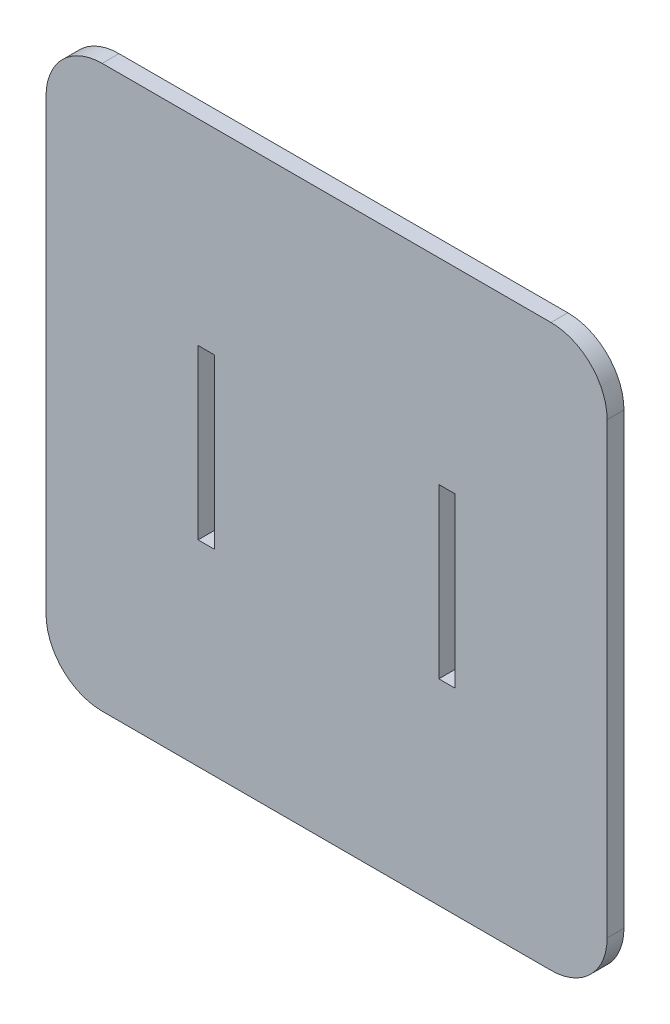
ISO-10303-21;
HEADER;
FILE_DESCRIPTION(('STEP AP214'),'2;1');
FILE_NAME('part.step','',(''),(''),'','','');
FILE_SCHEMA(('AUTOMOTIVE_DESIGN { 1 0 10303 214 1 1 1 1 }'));
ENDSEC;
DATA;
#1=APPLICATION_CONTEXT('core data for automotive mechanical design processes');
#2=APPLICATION_PROTOCOL_DEFINITION('international standard','automotive_design',2000,#1);
#3=PRODUCT_CONTEXT('',#1,'mechanical');
#4=PRODUCT('Part','Part','',(#3));
#5=PRODUCT_RELATED_PRODUCT_CATEGORY('part','',(#4));
#6=PRODUCT_DEFINITION_FORMATION('','',#4);
#7=PRODUCT_DEFINITION_CONTEXT('part definition',#1,'design');
#8=PRODUCT_DEFINITION('design','',#6,#7);
#9=PRODUCT_DEFINITION_SHAPE('','',#8);
#10=(LENGTH_UNIT() NAMED_UNIT(*) SI_UNIT(.MILLI.,.METRE.));
#11=(NAMED_UNIT(*) PLANE_ANGLE_UNIT() SI_UNIT($,.RADIAN.));
#12=(NAMED_UNIT(*) SI_UNIT($,.STERADIAN.) SOLID_ANGLE_UNIT());
#13=UNCERTAINTY_MEASURE_WITH_UNIT(LENGTH_MEASURE(1.E-05),#10,'distance_accuracy_value','');
#14=(GEOMETRIC_REPRESENTATION_CONTEXT(3) GLOBAL_UNCERTAINTY_ASSIGNED_CONTEXT((#13)) GLOBAL_UNIT_ASSIGNED_CONTEXT((#10,
#11,#12)) REPRESENTATION_CONTEXT('',''));
#15=CARTESIAN_POINT('',(0.,0.,0.));
#16=DIRECTION('',(0.,0.,1.));
#17=DIRECTION('',(1.,0.,0.));
#18=AXIS2_PLACEMENT_3D('',#15,#16,#17);
#19=CARTESIAN_POINT('',(-40.,-40.,3.));
#20=DIRECTION('',(0.,0.,1.));
#21=DIRECTION('',(1.,0.,0.));
#22=AXIS2_PLACEMENT_3D('',#19,#20,#21);
#23=PLANE('',#22);
#24=CARTESIAN_POINT('',(-40.,-40.,3.));
#25=DIRECTION('',(0.,0.,1.));
#26=DIRECTION('',(1.,0.,0.));
#27=AXIS2_PLACEMENT_3D('',#24,#25,#26);
#28=CIRCLE('',#27,9.99999999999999);
#29=CARTESIAN_POINT('',(-50.,-40.,3.));
#30=VERTEX_POINT('',#29);
#31=CARTESIAN_POINT('',(-40.,-50.,3.));
#32=VERTEX_POINT('',#31);
#33=EDGE_CURVE('E213',#30,#32,#28,.T.);
#34=ORIENTED_EDGE('',*,*,#33,.T.);
#35=DIRECTION('',(1.,0.,0.));
#36=VECTOR('',#35,1.);
#37=CARTESIAN_POINT('',(-40.,-50.,3.));
#38=LINE('',#37,#36);
#39=CARTESIAN_POINT('',(40.,-50.,3.));
#40=VERTEX_POINT('',#39);
#41=EDGE_CURVE('E216',#32,#40,#38,.T.);
#42=ORIENTED_EDGE('',*,*,#41,.T.);
#43=CARTESIAN_POINT('',(40.,-40.,3.));
#44=DIRECTION('',(0.,0.,1.));
#45=DIRECTION('',(1.,0.,0.));
#46=AXIS2_PLACEMENT_3D('',#43,#44,#45);
#47=CIRCLE('',#46,10.);
#48=CARTESIAN_POINT('',(50.,-40.,3.));
#49=VERTEX_POINT('',#48);
#50=EDGE_CURVE('E219',#40,#49,#47,.T.);
#51=ORIENTED_EDGE('',*,*,#50,.T.);
#52=DIRECTION('',(0.,1.,0.));
#53=VECTOR('',#52,1.);
#54=CARTESIAN_POINT('',(50.,40.,3.));
#55=LINE('',#54,#53);
#56=CARTESIAN_POINT('',(50.,40.,3.));
#57=VERTEX_POINT('',#56);
#58=EDGE_CURVE('E221',#49,#57,#55,.T.);
#59=ORIENTED_EDGE('',*,*,#58,.T.);
#60=CARTESIAN_POINT('',(40.,40.,3.));
#61=DIRECTION('',(0.,0.,1.));
#62=DIRECTION('',(1.,0.,0.));
#63=AXIS2_PLACEMENT_3D('',#60,#61,#62);
#64=CIRCLE('',#63,10.);
#65=CARTESIAN_POINT('',(40.,50.,3.));
#66=VERTEX_POINT('',#65);
#67=EDGE_CURVE('E223',#57,#66,#64,.T.);
#68=ORIENTED_EDGE('',*,*,#67,.T.);
#69=DIRECTION('',(-1.,0.,0.));
#70=VECTOR('',#69,1.);
#71=CARTESIAN_POINT('',(-40.,50.,3.));
#72=LINE('',#71,#70);
#73=CARTESIAN_POINT('',(-40.,50.,3.));
#74=VERTEX_POINT('',#73);
#75=EDGE_CURVE('E225',#66,#74,#72,.T.);
#76=ORIENTED_EDGE('',*,*,#75,.T.);
#77=CARTESIAN_POINT('',(-40.,40.,3.));
#78=DIRECTION('',(0.,0.,1.));
#79=DIRECTION('',(1.,0.,0.));
#80=AXIS2_PLACEMENT_3D('',#77,#78,#79);
#81=CIRCLE('',#80,10.);
#82=CARTESIAN_POINT('',(-50.,40.,3.));
#83=VERTEX_POINT('',#82);
#84=EDGE_CURVE('E227',#74,#83,#81,.T.);
#85=ORIENTED_EDGE('',*,*,#84,.T.);
#86=DIRECTION('',(0.,-1.,0.));
#87=VECTOR('',#86,1.);
#88=CARTESIAN_POINT('',(-50.,40.,3.));
#89=LINE('',#88,#87);
#90=EDGE_CURVE('E229',#83,#30,#89,.T.);
#91=ORIENTED_EDGE('',*,*,#90,.T.);
#92=EDGE_LOOP('',(#34,#42,#51,#59,#68,#76,#85,#91));
#93=FACE_BOUND('',#92,.T.);
#94=DIRECTION('',(-1.,0.,0.));
#95=VECTOR('',#94,1.);
#96=CARTESIAN_POINT('',(-22.9,15.,3.));
#97=LINE('',#96,#95);
#98=CARTESIAN_POINT('',(-20.,15.,3.));
#99=VERTEX_POINT('',#98);
#100=CARTESIAN_POINT('',(-22.9,15.,3.));
#101=VERTEX_POINT('',#100);
#102=EDGE_CURVE('E184',#99,#101,#97,.T.);
#103=ORIENTED_EDGE('',*,*,#102,.F.);
#104=DIRECTION('',(0.,1.,0.));
#105=VECTOR('',#104,1.);
#106=CARTESIAN_POINT('',(-20.,15.,3.));
#107=LINE('',#106,#105);
#108=CARTESIAN_POINT('',(-20.,-15.,3.));
#109=VERTEX_POINT('',#108);
#110=EDGE_CURVE('E182',#109,#99,#107,.T.);
#111=ORIENTED_EDGE('',*,*,#110,.F.);
#112=DIRECTION('',(1.,0.,0.));
#113=VECTOR('',#112,1.);
#114=CARTESIAN_POINT('',(-22.9,-15.,3.));
#115=LINE('',#114,#113);
#116=CARTESIAN_POINT('',(-22.9,-15.,3.));
#117=VERTEX_POINT('',#116);
#118=EDGE_CURVE('E190',#117,#109,#115,.T.);
#119=ORIENTED_EDGE('',*,*,#118,.F.);
#120=DIRECTION('',(0.,-1.,0.));
#121=VECTOR('',#120,1.);
#122=CARTESIAN_POINT('',(-22.9,15.,3.));
#123=LINE('',#122,#121);
#124=EDGE_CURVE('E187',#101,#117,#123,.T.);
#125=ORIENTED_EDGE('',*,*,#124,.F.);
#126=EDGE_LOOP('',(#103,#111,#119,#125));
#127=FACE_BOUND('',#126,.T.);
#128=DIRECTION('',(-1.,0.,0.));
#129=VECTOR('',#128,1.);
#130=CARTESIAN_POINT('',(22.9,15.,3.));
#131=LINE('',#130,#129);
#132=CARTESIAN_POINT('',(22.9,15.,3.));
#133=VERTEX_POINT('',#132);
#134=CARTESIAN_POINT('',(20.,15.,3.));
#135=VERTEX_POINT('',#134);
#136=EDGE_CURVE('E154',#133,#135,#131,.T.);
#137=ORIENTED_EDGE('',*,*,#136,.F.);
#138=DIRECTION('',(0.,1.,0.));
#139=VECTOR('',#138,1.);
#140=CARTESIAN_POINT('',(22.9,15.,3.));
#141=LINE('',#140,#139);
#142=CARTESIAN_POINT('',(22.9,-15.,3.));
#143=VERTEX_POINT('',#142);
#144=EDGE_CURVE('E146',#143,#133,#141,.T.);
#145=ORIENTED_EDGE('',*,*,#144,.F.);
#146=DIRECTION('',(1.,0.,0.));
#147=VECTOR('',#146,1.);
#148=CARTESIAN_POINT('',(22.9,-15.,3.));
#149=LINE('',#148,#147);
#150=CARTESIAN_POINT('',(20.,-15.,3.));
#151=VERTEX_POINT('',#150);
#152=EDGE_CURVE('E168',#151,#143,#149,.T.);
#153=ORIENTED_EDGE('',*,*,#152,.F.);
#154=DIRECTION('',(0.,-1.,0.));
#155=VECTOR('',#154,1.);
#156=CARTESIAN_POINT('',(20.,15.,3.));
#157=LINE('',#156,#155);
#158=EDGE_CURVE('E166',#135,#151,#157,.T.);
#159=ORIENTED_EDGE('',*,*,#158,.F.);
#160=EDGE_LOOP('',(#137,#145,#153,#159));
#161=FACE_BOUND('',#160,.T.);
#162=ADVANCED_FACE('F33',(#93,#127,#161),#23,.T.);
#163=CARTESIAN_POINT('',(-40.,-40.,0.));
#164=DIRECTION('',(0.,0.,1.));
#165=DIRECTION('',(1.,0.,0.));
#166=AXIS2_PLACEMENT_3D('',#163,#164,#165);
#167=PLANE('',#166);
#168=DIRECTION('',(0.,1.,0.));
#169=VECTOR('',#168,1.);
#170=CARTESIAN_POINT('',(-20.,15.,0.));
#171=LINE('',#170,#169);
#172=CARTESIAN_POINT('',(-20.,-15.,0.));
#173=VERTEX_POINT('',#172);
#174=CARTESIAN_POINT('',(-20.,15.,0.));
#175=VERTEX_POINT('',#174);
#176=EDGE_CURVE('E162',#173,#175,#171,.T.);
#177=ORIENTED_EDGE('',*,*,#176,.T.);
#178=DIRECTION('',(-1.,0.,0.));
#179=VECTOR('',#178,1.);
#180=CARTESIAN_POINT('',(-22.9,15.,0.));
#181=LINE('',#180,#179);
#182=CARTESIAN_POINT('',(-22.9,15.,0.));
#183=VERTEX_POINT('',#182);
#184=EDGE_CURVE('E195',#175,#183,#181,.T.);
#185=ORIENTED_EDGE('',*,*,#184,.T.);
#186=DIRECTION('',(0.,-1.,0.));
#187=VECTOR('',#186,1.);
#188=CARTESIAN_POINT('',(-22.9,15.,0.));
#189=LINE('',#188,#187);
#190=CARTESIAN_POINT('',(-22.9,-15.,0.));
#191=VERTEX_POINT('',#190);
#192=EDGE_CURVE('E198',#183,#191,#189,.T.);
#193=ORIENTED_EDGE('',*,*,#192,.T.);
#194=DIRECTION('',(1.,0.,0.));
#195=VECTOR('',#194,1.);
#196=CARTESIAN_POINT('',(-22.9,-15.,0.));
#197=LINE('',#196,#195);
#198=EDGE_CURVE('E185',#191,#173,#197,.T.);
#199=ORIENTED_EDGE('',*,*,#198,.T.);
#200=EDGE_LOOP('',(#177,#185,#193,#199));
#201=FACE_BOUND('',#200,.T.);
#202=CARTESIAN_POINT('',(-40.,-40.,0.));
#203=DIRECTION('',(0.,0.,1.));
#204=DIRECTION('',(1.,0.,0.));
#205=AXIS2_PLACEMENT_3D('',#202,#203,#204);
#206=CIRCLE('',#205,9.99999999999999);
#207=CARTESIAN_POINT('',(-50.,-40.,0.));
#208=VERTEX_POINT('',#207);
#209=CARTESIAN_POINT('',(-40.,-50.,0.));
#210=VERTEX_POINT('',#209);
#211=EDGE_CURVE('E212',#208,#210,#206,.T.);
#212=ORIENTED_EDGE('',*,*,#211,.F.);
#213=DIRECTION('',(0.,-1.,0.));
#214=VECTOR('',#213,1.);
#215=CARTESIAN_POINT('',(-50.,40.,0.));
#216=LINE('',#215,#214);
#217=CARTESIAN_POINT('',(-50.,40.,0.));
#218=VERTEX_POINT('',#217);
#219=EDGE_CURVE('E217',#218,#208,#216,.T.);
#220=ORIENTED_EDGE('',*,*,#219,.F.);
#221=CARTESIAN_POINT('',(-40.,40.,0.));
#222=DIRECTION('',(0.,0.,1.));
#223=DIRECTION('',(1.,0.,0.));
#224=AXIS2_PLACEMENT_3D('',#221,#222,#223);
#225=CIRCLE('',#224,10.);
#226=CARTESIAN_POINT('',(-40.,50.,0.));
#227=VERTEX_POINT('',#226);
#228=EDGE_CURVE('E244',#227,#218,#225,.T.);
#229=ORIENTED_EDGE('',*,*,#228,.F.);
#230=DIRECTION('',(-1.,0.,0.));
#231=VECTOR('',#230,1.);
#232=CARTESIAN_POINT('',(-40.,50.,0.));
#233=LINE('',#232,#231);
#234=CARTESIAN_POINT('',(40.,50.,0.));
#235=VERTEX_POINT('',#234);
#236=EDGE_CURVE('E242',#235,#227,#233,.T.);
#237=ORIENTED_EDGE('',*,*,#236,.F.);
#238=CARTESIAN_POINT('',(40.,40.,0.));
#239=DIRECTION('',(0.,0.,1.));
#240=DIRECTION('',(1.,0.,0.));
#241=AXIS2_PLACEMENT_3D('',#238,#239,#240);
#242=CIRCLE('',#241,10.);
#243=CARTESIAN_POINT('',(50.,40.,0.));
#244=VERTEX_POINT('',#243);
#245=EDGE_CURVE('E240',#244,#235,#242,.T.);
#246=ORIENTED_EDGE('',*,*,#245,.F.);
#247=DIRECTION('',(0.,1.,0.));
#248=VECTOR('',#247,1.);
#249=CARTESIAN_POINT('',(50.,40.,0.));
#250=LINE('',#249,#248);
#251=CARTESIAN_POINT('',(50.,-40.,0.));
#252=VERTEX_POINT('',#251);
#253=EDGE_CURVE('E238',#252,#244,#250,.T.);
#254=ORIENTED_EDGE('',*,*,#253,.F.);
#255=CARTESIAN_POINT('',(40.,-40.,0.));
#256=DIRECTION('',(0.,0.,1.));
#257=DIRECTION('',(1.,0.,0.));
#258=AXIS2_PLACEMENT_3D('',#255,#256,#257);
#259=CIRCLE('',#258,10.);
#260=CARTESIAN_POINT('',(40.,-50.,0.));
#261=VERTEX_POINT('',#260);
#262=EDGE_CURVE('E236',#261,#252,#259,.T.);
#263=ORIENTED_EDGE('',*,*,#262,.F.);
#264=DIRECTION('',(1.,0.,0.));
#265=VECTOR('',#264,1.);
#266=CARTESIAN_POINT('',(-40.,-50.,0.));
#267=LINE('',#266,#265);
#268=EDGE_CURVE('E234',#210,#261,#267,.T.);
#269=ORIENTED_EDGE('',*,*,#268,.F.);
#270=EDGE_LOOP('',(#212,#220,#229,#237,#246,#254,#263,#269));
#271=FACE_BOUND('',#270,.T.);
#272=DIRECTION('',(0.,1.,0.));
#273=VECTOR('',#272,1.);
#274=CARTESIAN_POINT('',(22.9,15.,0.));
#275=LINE('',#274,#273);
#276=CARTESIAN_POINT('',(22.9,-15.,0.));
#277=VERTEX_POINT('',#276);
#278=CARTESIAN_POINT('',(22.9,15.,0.));
#279=VERTEX_POINT('',#278);
#280=EDGE_CURVE('E56',#277,#279,#275,.T.);
#281=ORIENTED_EDGE('',*,*,#280,.T.);
#282=DIRECTION('',(-1.,0.,0.));
#283=VECTOR('',#282,1.);
#284=CARTESIAN_POINT('',(22.9,15.,0.));
#285=LINE('',#284,#283);
#286=CARTESIAN_POINT('',(20.,15.,0.));
#287=VERTEX_POINT('',#286);
#288=EDGE_CURVE('E161',#279,#287,#285,.T.);
#289=ORIENTED_EDGE('',*,*,#288,.T.);
#290=DIRECTION('',(0.,-1.,0.));
#291=VECTOR('',#290,1.);
#292=CARTESIAN_POINT('',(20.,15.,0.));
#293=LINE('',#292,#291);
#294=CARTESIAN_POINT('',(20.,-15.,0.));
#295=VERTEX_POINT('',#294);
#296=EDGE_CURVE('E174',#287,#295,#293,.T.);
#297=ORIENTED_EDGE('',*,*,#296,.T.);
#298=DIRECTION('',(1.,0.,0.));
#299=VECTOR('',#298,1.);
#300=CARTESIAN_POINT('',(22.9,-15.,0.));
#301=LINE('',#300,#299);
#302=EDGE_CURVE('E155',#295,#277,#301,.T.);
#303=ORIENTED_EDGE('',*,*,#302,.T.);
#304=EDGE_LOOP('',(#281,#289,#297,#303));
#305=FACE_BOUND('',#304,.T.);
#306=ADVANCED_FACE('F274',(#201,#271,#305),#167,.F.);
#307=CARTESIAN_POINT('',(-40.,-40.,3.));
#308=DIRECTION('',(0.,0.,-1.));
#309=DIRECTION('',(-1.,0.,0.));
#310=AXIS2_PLACEMENT_3D('',#307,#308,#309);
#311=CYLINDRICAL_SURFACE('',#310,9.99999999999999);
#312=ORIENTED_EDGE('',*,*,#211,.T.);
#313=DIRECTION('',(0.,0.,-1.));
#314=VECTOR('',#313,1.);
#315=CARTESIAN_POINT('',(-40.,-50.,3.));
#316=LINE('',#315,#314);
#317=EDGE_CURVE('E11',#32,#210,#316,.T.);
#318=ORIENTED_EDGE('',*,*,#317,.F.);
#319=ORIENTED_EDGE('',*,*,#33,.F.);
#320=DIRECTION('',(0.,0.,-1.));
#321=VECTOR('',#320,1.);
#322=CARTESIAN_POINT('',(-50.,-40.,3.));
#323=LINE('',#322,#321);
#324=EDGE_CURVE('E231',#30,#208,#323,.T.);
#325=ORIENTED_EDGE('',*,*,#324,.T.);
#326=EDGE_LOOP('',(#312,#318,#319,#325));
#327=FACE_BOUND('',#326,.T.);
#328=ADVANCED_FACE('F35',(#327),#311,.T.);
#329=CARTESIAN_POINT('',(-40.,-50.,3.));
#330=DIRECTION('',(0.,1.,0.));
#331=DIRECTION('',(-1.,0.,0.));
#332=AXIS2_PLACEMENT_3D('',#329,#330,#331);
#333=PLANE('',#332);
#334=ORIENTED_EDGE('',*,*,#268,.T.);
#335=DIRECTION('',(0.,0.,-1.));
#336=VECTOR('',#335,1.);
#337=CARTESIAN_POINT('',(40.,-50.,3.));
#338=LINE('',#337,#336);
#339=EDGE_CURVE('E41',#40,#261,#338,.T.);
#340=ORIENTED_EDGE('',*,*,#339,.F.);
#341=ORIENTED_EDGE('',*,*,#41,.F.);
#342=ORIENTED_EDGE('',*,*,#317,.T.);
#343=EDGE_LOOP('',(#334,#340,#341,#342));
#344=FACE_BOUND('',#343,.T.);
#345=ADVANCED_FACE('F292',(#344),#333,.F.);
#346=CARTESIAN_POINT('',(40.,-40.,3.));
#347=DIRECTION('',(0.,0.,-1.));
#348=DIRECTION('',(-1.,0.,0.));
#349=AXIS2_PLACEMENT_3D('',#346,#347,#348);
#350=CYLINDRICAL_SURFACE('',#349,10.);
#351=ORIENTED_EDGE('',*,*,#262,.T.);
#352=DIRECTION('',(0.,0.,-1.));
#353=VECTOR('',#352,1.);
#354=CARTESIAN_POINT('',(50.,-40.,3.));
#355=LINE('',#354,#353);
#356=EDGE_CURVE('E261',#49,#252,#355,.T.);
#357=ORIENTED_EDGE('',*,*,#356,.F.);
#358=ORIENTED_EDGE('',*,*,#50,.F.);
#359=ORIENTED_EDGE('',*,*,#339,.T.);
#360=EDGE_LOOP('',(#351,#357,#358,#359));
#361=FACE_BOUND('',#360,.T.);
#362=ADVANCED_FACE('F268',(#361),#350,.T.);
#363=CARTESIAN_POINT('',(50.,40.,3.));
#364=DIRECTION('',(-1.,0.,0.));
#365=DIRECTION('',(0.,-1.,0.));
#366=AXIS2_PLACEMENT_3D('',#363,#364,#365);
#367=PLANE('',#366);
#368=ORIENTED_EDGE('',*,*,#253,.T.);
#369=DIRECTION('',(0.,0.,-1.));
#370=VECTOR('',#369,1.);
#371=CARTESIAN_POINT('',(50.,40.,3.));
#372=LINE('',#371,#370);
#373=EDGE_CURVE('E258',#57,#244,#372,.T.);
#374=ORIENTED_EDGE('',*,*,#373,.F.);
#375=ORIENTED_EDGE('',*,*,#58,.F.);
#376=ORIENTED_EDGE('',*,*,#356,.T.);
#377=EDGE_LOOP('',(#368,#374,#375,#376));
#378=FACE_BOUND('',#377,.T.);
#379=ADVANCED_FACE('F280',(#378),#367,.F.);
#380=CARTESIAN_POINT('',(40.,40.,3.));
#381=DIRECTION('',(0.,0.,-1.));
#382=DIRECTION('',(-1.,0.,0.));
#383=AXIS2_PLACEMENT_3D('',#380,#381,#382);
#384=CYLINDRICAL_SURFACE('',#383,10.);
#385=ORIENTED_EDGE('',*,*,#245,.T.);
#386=DIRECTION('',(0.,0.,-1.));
#387=VECTOR('',#386,1.);
#388=CARTESIAN_POINT('',(40.,50.,3.));
#389=LINE('',#388,#387);
#390=EDGE_CURVE('E255',#66,#235,#389,.T.);
#391=ORIENTED_EDGE('',*,*,#390,.F.);
#392=ORIENTED_EDGE('',*,*,#67,.F.);
#393=ORIENTED_EDGE('',*,*,#373,.T.);
#394=EDGE_LOOP('',(#385,#391,#392,#393));
#395=FACE_BOUND('',#394,.T.);
#396=ADVANCED_FACE('F284',(#395),#384,.T.);
#397=CARTESIAN_POINT('',(-40.,50.,3.));
#398=DIRECTION('',(0.,-1.,0.));
#399=DIRECTION('',(0.,0.,-1.));
#400=AXIS2_PLACEMENT_3D('',#397,#398,#399);
#401=PLANE('',#400);
#402=ORIENTED_EDGE('',*,*,#236,.T.);
#403=DIRECTION('',(0.,0.,-1.));
#404=VECTOR('',#403,1.);
#405=CARTESIAN_POINT('',(-40.,50.,3.));
#406=LINE('',#405,#404);
#407=EDGE_CURVE('E252',#74,#227,#406,.T.);
#408=ORIENTED_EDGE('',*,*,#407,.F.);
#409=ORIENTED_EDGE('',*,*,#75,.F.);
#410=ORIENTED_EDGE('',*,*,#390,.T.);
#411=EDGE_LOOP('',(#402,#408,#409,#410));
#412=FACE_BOUND('',#411,.T.);
#413=ADVANCED_FACE('F305',(#412),#401,.F.);
#414=CARTESIAN_POINT('',(-40.,40.,3.));
#415=DIRECTION('',(0.,0.,-1.));
#416=DIRECTION('',(-1.,0.,0.));
#417=AXIS2_PLACEMENT_3D('',#414,#415,#416);
#418=CYLINDRICAL_SURFACE('',#417,10.);
#419=ORIENTED_EDGE('',*,*,#228,.T.);
#420=DIRECTION('',(0.,0.,-1.));
#421=VECTOR('',#420,1.);
#422=CARTESIAN_POINT('',(-50.,40.,3.));
#423=LINE('',#422,#421);
#424=EDGE_CURVE('E249',#83,#218,#423,.T.);
#425=ORIENTED_EDGE('',*,*,#424,.F.);
#426=ORIENTED_EDGE('',*,*,#84,.F.);
#427=ORIENTED_EDGE('',*,*,#407,.T.);
#428=EDGE_LOOP('',(#419,#425,#426,#427));
#429=FACE_BOUND('',#428,.T.);
#430=ADVANCED_FACE('F303',(#429),#418,.T.);
#431=CARTESIAN_POINT('',(-50.,40.,3.));
#432=DIRECTION('',(1.,0.,0.));
#433=DIRECTION('',(0.,1.,0.));
#434=AXIS2_PLACEMENT_3D('',#431,#432,#433);
#435=PLANE('',#434);
#436=ORIENTED_EDGE('',*,*,#219,.T.);
#437=ORIENTED_EDGE('',*,*,#324,.F.);
#438=ORIENTED_EDGE('',*,*,#90,.F.);
#439=ORIENTED_EDGE('',*,*,#424,.T.);
#440=EDGE_LOOP('',(#436,#437,#438,#439));
#441=FACE_BOUND('',#440,.T.);
#442=ADVANCED_FACE('F298',(#441),#435,.F.);
#443=CARTESIAN_POINT('',(-20.,15.,3.));
#444=DIRECTION('',(-1.,0.,0.));
#445=DIRECTION('',(0.,-1.,0.));
#446=AXIS2_PLACEMENT_3D('',#443,#444,#445);
#447=PLANE('',#446);
#448=ORIENTED_EDGE('',*,*,#176,.F.);
#449=DIRECTION('',(0.,0.,-1.));
#450=VECTOR('',#449,1.);
#451=CARTESIAN_POINT('',(-20.,-15.,3.));
#452=LINE('',#451,#450);
#453=EDGE_CURVE('E192',#109,#173,#452,.T.);
#454=ORIENTED_EDGE('',*,*,#453,.F.);
#455=ORIENTED_EDGE('',*,*,#110,.T.);
#456=DIRECTION('',(0.,0.,-1.));
#457=VECTOR('',#456,1.);
#458=CARTESIAN_POINT('',(-20.,15.,3.));
#459=LINE('',#458,#457);
#460=EDGE_CURVE('E209',#99,#175,#459,.T.);
#461=ORIENTED_EDGE('',*,*,#460,.T.);
#462=EDGE_LOOP('',(#448,#454,#455,#461));
#463=FACE_BOUND('',#462,.T.);
#464=ADVANCED_FACE('F322',(#463),#447,.T.);
#465=CARTESIAN_POINT('',(-22.9,15.,3.));
#466=DIRECTION('',(0.,-1.,0.));
#467=DIRECTION('',(0.,0.,-1.));
#468=AXIS2_PLACEMENT_3D('',#465,#466,#467);
#469=PLANE('',#468);
#470=ORIENTED_EDGE('',*,*,#184,.F.);
#471=ORIENTED_EDGE('',*,*,#460,.F.);
#472=ORIENTED_EDGE('',*,*,#102,.T.);
#473=DIRECTION('',(0.,0.,-1.));
#474=VECTOR('',#473,1.);
#475=CARTESIAN_POINT('',(-22.9,15.,3.));
#476=LINE('',#475,#474);
#477=EDGE_CURVE('E207',#101,#183,#476,.T.);
#478=ORIENTED_EDGE('',*,*,#477,.T.);
#479=EDGE_LOOP('',(#470,#471,#472,#478));
#480=FACE_BOUND('',#479,.T.);
#481=ADVANCED_FACE('F329',(#480),#469,.T.);
#482=CARTESIAN_POINT('',(-22.9,15.,3.));
#483=DIRECTION('',(1.,0.,0.));
#484=DIRECTION('',(0.,1.,0.));
#485=AXIS2_PLACEMENT_3D('',#482,#483,#484);
#486=PLANE('',#485);
#487=ORIENTED_EDGE('',*,*,#192,.F.);
#488=ORIENTED_EDGE('',*,*,#477,.F.);
#489=ORIENTED_EDGE('',*,*,#124,.T.);
#490=DIRECTION('',(0.,0.,-1.));
#491=VECTOR('',#490,1.);
#492=CARTESIAN_POINT('',(-22.9,-15.,3.));
#493=LINE('',#492,#491);
#494=EDGE_CURVE('E205',#117,#191,#493,.T.);
#495=ORIENTED_EDGE('',*,*,#494,.T.);
#496=EDGE_LOOP('',(#487,#488,#489,#495));
#497=FACE_BOUND('',#496,.T.);
#498=ADVANCED_FACE('F334',(#497),#486,.T.);
#499=CARTESIAN_POINT('',(-22.9,-15.,3.));
#500=DIRECTION('',(0.,1.,0.));
#501=DIRECTION('',(0.,0.,1.));
#502=AXIS2_PLACEMENT_3D('',#499,#500,#501);
#503=PLANE('',#502);
#504=ORIENTED_EDGE('',*,*,#198,.F.);
#505=ORIENTED_EDGE('',*,*,#494,.F.);
#506=ORIENTED_EDGE('',*,*,#118,.T.);
#507=ORIENTED_EDGE('',*,*,#453,.T.);
#508=EDGE_LOOP('',(#504,#505,#506,#507));
#509=FACE_BOUND('',#508,.T.);
#510=ADVANCED_FACE('F341',(#509),#503,.T.);
#511=CARTESIAN_POINT('',(22.9,15.,3.));
#512=DIRECTION('',(-1.,0.,0.));
#513=DIRECTION('',(0.,-1.,0.));
#514=AXIS2_PLACEMENT_3D('',#511,#512,#513);
#515=PLANE('',#514);
#516=ORIENTED_EDGE('',*,*,#280,.F.);
#517=DIRECTION('',(0.,0.,-1.));
#518=VECTOR('',#517,1.);
#519=CARTESIAN_POINT('',(22.9,-15.,3.));
#520=LINE('',#519,#518);
#521=EDGE_CURVE('E150',#143,#277,#520,.T.);
#522=ORIENTED_EDGE('',*,*,#521,.F.);
#523=ORIENTED_EDGE('',*,*,#144,.T.);
#524=DIRECTION('',(0.,0.,-1.));
#525=VECTOR('',#524,1.);
#526=CARTESIAN_POINT('',(22.9,15.,3.));
#527=LINE('',#526,#525);
#528=EDGE_CURVE('E149',#133,#279,#527,.T.);
#529=ORIENTED_EDGE('',*,*,#528,.T.);
#530=EDGE_LOOP('',(#516,#522,#523,#529));
#531=FACE_BOUND('',#530,.T.);
#532=ADVANCED_FACE('F148',(#531),#515,.T.);
#533=CARTESIAN_POINT('',(22.9,15.,3.));
#534=DIRECTION('',(0.,-1.,0.));
#535=DIRECTION('',(0.,0.,-1.));
#536=AXIS2_PLACEMENT_3D('',#533,#534,#535);
#537=PLANE('',#536);
#538=ORIENTED_EDGE('',*,*,#288,.F.);
#539=ORIENTED_EDGE('',*,*,#528,.F.);
#540=ORIENTED_EDGE('',*,*,#136,.T.);
#541=DIRECTION('',(0.,0.,-1.));
#542=VECTOR('',#541,1.);
#543=CARTESIAN_POINT('',(20.,15.,3.));
#544=LINE('',#543,#542);
#545=EDGE_CURVE('E163',#135,#287,#544,.T.);
#546=ORIENTED_EDGE('',*,*,#545,.T.);
#547=EDGE_LOOP('',(#538,#539,#540,#546));
#548=FACE_BOUND('',#547,.T.);
#549=ADVANCED_FACE('F158',(#548),#537,.T.);
#550=CARTESIAN_POINT('',(20.,15.,3.));
#551=DIRECTION('',(1.,0.,0.));
#552=DIRECTION('',(0.,1.,0.));
#553=AXIS2_PLACEMENT_3D('',#550,#551,#552);
#554=PLANE('',#553);
#555=ORIENTED_EDGE('',*,*,#296,.F.);
#556=ORIENTED_EDGE('',*,*,#545,.F.);
#557=ORIENTED_EDGE('',*,*,#158,.T.);
#558=DIRECTION('',(0.,0.,-1.));
#559=VECTOR('',#558,1.);
#560=CARTESIAN_POINT('',(20.,-15.,3.));
#561=LINE('',#560,#559);
#562=EDGE_CURVE('E48',#151,#295,#561,.T.);
#563=ORIENTED_EDGE('',*,*,#562,.T.);
#564=EDGE_LOOP('',(#555,#556,#557,#563));
#565=FACE_BOUND('',#564,.T.);
#566=ADVANCED_FACE('F359',(#565),#554,.T.);
#567=CARTESIAN_POINT('',(22.9,-15.,3.));
#568=DIRECTION('',(0.,1.,0.));
#569=DIRECTION('',(0.,0.,1.));
#570=AXIS2_PLACEMENT_3D('',#567,#568,#569);
#571=PLANE('',#570);
#572=ORIENTED_EDGE('',*,*,#302,.F.);
#573=ORIENTED_EDGE('',*,*,#562,.F.);
#574=ORIENTED_EDGE('',*,*,#152,.T.);
#575=ORIENTED_EDGE('',*,*,#521,.T.);
#576=EDGE_LOOP('',(#572,#573,#574,#575));
#577=FACE_BOUND('',#576,.T.);
#578=ADVANCED_FACE('F362',(#577),#571,.T.);
#579=CLOSED_SHELL('',(#162,#306,#328,#345,#362,#379,#396,#413,#430,#442,#464,#481,#498,#510,
#532,#549,#566,#578));
#580=MANIFOLD_SOLID_BREP('B2',#579);
#581=ADVANCED_BREP_SHAPE_REPRESENTATION('',(#18,#580),#14);
#582=SHAPE_DEFINITION_REPRESENTATION(#9,#581);
ENDSEC;
END-ISO-10303-21;
